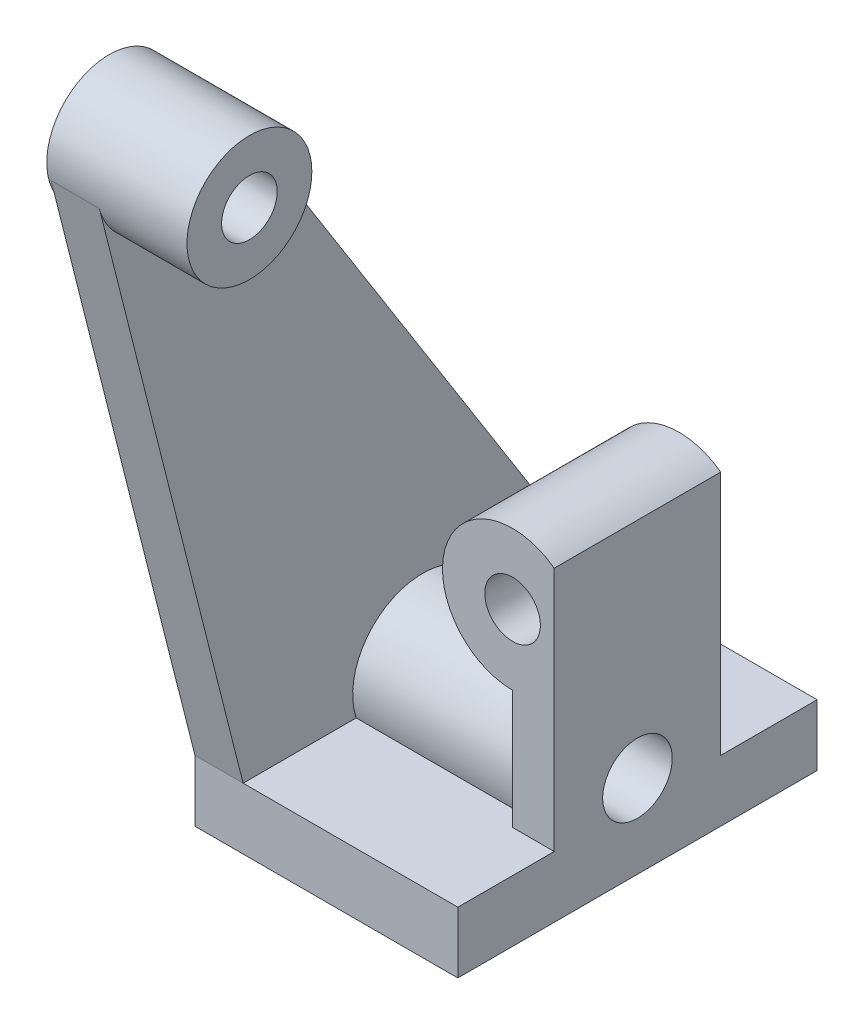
ISO-10303-21;
HEADER;
FILE_DESCRIPTION(('STEP AP214'),'2;1');
FILE_NAME('part.step','',(''),(''),'','','');
FILE_SCHEMA(('AUTOMOTIVE_DESIGN { 1 0 10303 214 1 1 1 1 }'));
ENDSEC;
DATA;
#1=APPLICATION_CONTEXT('core data for automotive mechanical design processes');
#2=APPLICATION_PROTOCOL_DEFINITION('international standard','automotive_design',2000,#1);
#3=PRODUCT_CONTEXT('',#1,'mechanical');
#4=PRODUCT('Part','Part','',(#3));
#5=PRODUCT_RELATED_PRODUCT_CATEGORY('part','',(#4));
#6=PRODUCT_DEFINITION_FORMATION('','',#4);
#7=PRODUCT_DEFINITION_CONTEXT('part definition',#1,'design');
#8=PRODUCT_DEFINITION('design','',#6,#7);
#9=PRODUCT_DEFINITION_SHAPE('','',#8);
#10=(LENGTH_UNIT() NAMED_UNIT(*) SI_UNIT(.MILLI.,.METRE.));
#11=(NAMED_UNIT(*) PLANE_ANGLE_UNIT() SI_UNIT($,.RADIAN.));
#12=(NAMED_UNIT(*) SI_UNIT($,.STERADIAN.) SOLID_ANGLE_UNIT());
#13=UNCERTAINTY_MEASURE_WITH_UNIT(LENGTH_MEASURE(1.E-05),#10,'distance_accuracy_value','');
#14=(GEOMETRIC_REPRESENTATION_CONTEXT(3) GLOBAL_UNCERTAINTY_ASSIGNED_CONTEXT((#13)) GLOBAL_UNIT_ASSIGNED_CONTEXT((#10,
#11,#12)) REPRESENTATION_CONTEXT('',''));
#15=CARTESIAN_POINT('',(0.,0.,0.));
#16=DIRECTION('',(0.,0.,1.));
#17=DIRECTION('',(1.,0.,0.));
#18=AXIS2_PLACEMENT_3D('',#15,#16,#17);
#19=CARTESIAN_POINT('',(60.,28.,82.));
#20=DIRECTION('',(0.,1.,0.));
#21=DIRECTION('',(0.,0.,1.));
#22=AXIS2_PLACEMENT_3D('',#19,#20,#21);
#23=PLANE('',#22);
#24=DIRECTION('',(1.,0.,0.));
#25=VECTOR('',#24,1.);
#26=CARTESIAN_POINT('',(-128.509667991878,28.,30.3973683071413));
#27=LINE('',#26,#25);
#28=CARTESIAN_POINT('',(-38.,28.,30.3973683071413));
#29=VERTEX_POINT('',#28);
#30=CARTESIAN_POINT('',(41.,28.,30.3973683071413));
#31=VERTEX_POINT('',#30);
#32=EDGE_CURVE('E129',#29,#31,#27,.T.);
#33=ORIENTED_EDGE('',*,*,#32,.F.);
#34=DIRECTION('',(0.,0.,1.));
#35=VECTOR('',#34,1.);
#36=CARTESIAN_POINT('',(-38.,28.,-82.));
#37=LINE('',#36,#35);
#38=CARTESIAN_POINT('',(-38.,28.,82.));
#39=VERTEX_POINT('',#38);
#40=EDGE_CURVE('E58',#29,#39,#37,.T.);
#41=ORIENTED_EDGE('',*,*,#40,.T.);
#42=DIRECTION('',(1.,0.,0.));
#43=VECTOR('',#42,1.);
#44=CARTESIAN_POINT('',(-60.,28.,82.));
#45=LINE('',#44,#43);
#46=CARTESIAN_POINT('',(60.,28.,82.));
#47=VERTEX_POINT('',#46);
#48=EDGE_CURVE('E214',#39,#47,#45,.T.);
#49=ORIENTED_EDGE('',*,*,#48,.T.);
#50=DIRECTION('',(0.,0.,-1.));
#51=VECTOR('',#50,1.);
#52=CARTESIAN_POINT('',(60.,28.,-82.));
#53=LINE('',#52,#51);
#54=CARTESIAN_POINT('',(60.,28.,38.));
#55=VERTEX_POINT('',#54);
#56=EDGE_CURVE('E207',#47,#55,#53,.T.);
#57=ORIENTED_EDGE('',*,*,#56,.T.);
#58=DIRECTION('',(1.,0.,0.));
#59=VECTOR('',#58,1.);
#60=CARTESIAN_POINT('',(60.,28.,38.));
#61=LINE('',#60,#59);
#62=CARTESIAN_POINT('',(41.,28.,38.));
#63=VERTEX_POINT('',#62);
#64=EDGE_CURVE('E204',#63,#55,#61,.T.);
#65=ORIENTED_EDGE('',*,*,#64,.F.);
#66=DIRECTION('',(0.,0.,-1.));
#67=VECTOR('',#66,1.);
#68=CARTESIAN_POINT('',(41.,28.,82.));
#69=LINE('',#68,#67);
#70=EDGE_CURVE('E136',#63,#31,#69,.T.);
#71=ORIENTED_EDGE('',*,*,#70,.T.);
#72=EDGE_LOOP('',(#33,#41,#49,#57,#65,#71));
#73=FACE_BOUND('',#72,.T.);
#74=ADVANCED_FACE('F35',(#73),#23,.T.);
#75=DIRECTION('',(1.,0.,0.));
#76=VECTOR('',#75,1.);
#77=CARTESIAN_POINT('',(-128.509667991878,28.,-30.3973683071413));
#78=LINE('',#77,#76);
#79=CARTESIAN_POINT('',(41.,28.,-30.3973683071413));
#80=VERTEX_POINT('',#79);
#81=CARTESIAN_POINT('',(-38.,28.,-30.3973683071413));
#82=VERTEX_POINT('',#81);
#83=EDGE_CURVE('E51',#80,#82,#78,.F.);
#84=ORIENTED_EDGE('',*,*,#83,.F.);
#85=CARTESIAN_POINT('',(41.,28.,-38.));
#86=VERTEX_POINT('',#85);
#87=EDGE_CURVE('E199',#80,#86,#69,.T.);
#88=ORIENTED_EDGE('',*,*,#87,.T.);
#89=DIRECTION('',(1.,0.,0.));
#90=VECTOR('',#89,1.);
#91=CARTESIAN_POINT('',(60.,28.,-38.));
#92=LINE('',#91,#90);
#93=CARTESIAN_POINT('',(60.,28.,-38.));
#94=VERTEX_POINT('',#93);
#95=EDGE_CURVE('E201',#86,#94,#92,.T.);
#96=ORIENTED_EDGE('',*,*,#95,.T.);
#97=CARTESIAN_POINT('',(60.,28.,-82.));
#98=VERTEX_POINT('',#97);
#99=EDGE_CURVE('E211',#94,#98,#53,.T.);
#100=ORIENTED_EDGE('',*,*,#99,.T.);
#101=DIRECTION('',(-1.,0.,0.));
#102=VECTOR('',#101,1.);
#103=CARTESIAN_POINT('',(-60.,28.,-82.));
#104=LINE('',#103,#102);
#105=CARTESIAN_POINT('',(-38.,28.,-82.));
#106=VERTEX_POINT('',#105);
#107=EDGE_CURVE('E210',#98,#106,#104,.T.);
#108=ORIENTED_EDGE('',*,*,#107,.T.);
#109=EDGE_CURVE('E143',#106,#82,#37,.T.);
#110=ORIENTED_EDGE('',*,*,#109,.T.);
#111=EDGE_LOOP('',(#84,#88,#96,#100,#108,#110));
#112=FACE_BOUND('',#111,.T.);
#113=ADVANCED_FACE('F266',(#112),#23,.T.);
#114=CARTESIAN_POINT('',(60.,28.,-82.));
#115=DIRECTION('',(-1.,0.,0.));
#116=DIRECTION('',(0.,0.,1.));
#117=AXIS2_PLACEMENT_3D('',#114,#115,#116);
#118=PLANE('',#117);
#119=CARTESIAN_POINT('',(60.,38.,0.));
#120=DIRECTION('',(1.,0.,0.));
#121=DIRECTION('',(0.,0.,-1.));
#122=AXIS2_PLACEMENT_3D('',#119,#120,#121);
#123=CIRCLE('',#122,15.875);
#124=CARTESIAN_POINT('',(60.,38.,-15.875));
#125=VERTEX_POINT('',#124);
#126=EDGE_CURVE('E290',#125,#125,#123,.T.);
#127=ORIENTED_EDGE('',*,*,#126,.F.);
#128=EDGE_LOOP('',(#127));
#129=FACE_BOUND('',#128,.T.);
#130=DIRECTION('',(0.,0.,-1.));
#131=VECTOR('',#130,1.);
#132=CARTESIAN_POINT('',(60.,0.,-82.));
#133=LINE('',#132,#131);
#134=CARTESIAN_POINT('',(60.,0.,82.));
#135=VERTEX_POINT('',#134);
#136=CARTESIAN_POINT('',(60.,0.,-82.));
#137=VERTEX_POINT('',#136);
#138=EDGE_CURVE('E206',#135,#137,#133,.T.);
#139=ORIENTED_EDGE('',*,*,#138,.T.);
#140=DIRECTION('',(0.,-1.,0.));
#141=VECTOR('',#140,1.);
#142=CARTESIAN_POINT('',(60.,28.,-82.));
#143=LINE('',#142,#141);
#144=EDGE_CURVE('E44',#98,#137,#143,.T.);
#145=ORIENTED_EDGE('',*,*,#144,.F.);
#146=ORIENTED_EDGE('',*,*,#99,.F.);
#147=DIRECTION('',(0.,1.,0.));
#148=VECTOR('',#147,1.);
#149=CARTESIAN_POINT('',(60.,0.,-38.));
#150=LINE('',#149,#148);
#151=CARTESIAN_POINT('',(60.,139.998786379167,-38.));
#152=VERTEX_POINT('',#151);
#153=EDGE_CURVE('E177',#94,#152,#150,.T.);
#154=ORIENTED_EDGE('',*,*,#153,.T.);
#155=DIRECTION('',(0.,0.,-1.));
#156=VECTOR('',#155,1.);
#157=CARTESIAN_POINT('',(60.,139.998786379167,38.));
#158=LINE('',#157,#156);
#159=CARTESIAN_POINT('',(60.,139.998786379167,38.));
#160=VERTEX_POINT('',#159);
#161=EDGE_CURVE('E196',#160,#152,#158,.T.);
#162=ORIENTED_EDGE('',*,*,#161,.F.);
#163=DIRECTION('',(0.,1.,0.));
#164=VECTOR('',#163,1.);
#165=CARTESIAN_POINT('',(60.,0.,38.));
#166=LINE('',#165,#164);
#167=EDGE_CURVE('E180',#55,#160,#166,.T.);
#168=ORIENTED_EDGE('',*,*,#167,.F.);
#169=ORIENTED_EDGE('',*,*,#56,.F.);
#170=DIRECTION('',(0.,-1.,0.));
#171=VECTOR('',#170,1.);
#172=CARTESIAN_POINT('',(60.,28.,82.));
#173=LINE('',#172,#171);
#174=EDGE_CURVE('E218',#47,#135,#173,.T.);
#175=ORIENTED_EDGE('',*,*,#174,.T.);
#176=EDGE_LOOP('',(#139,#145,#146,#154,#162,#168,#169,#175));
#177=FACE_BOUND('',#176,.T.);
#178=ADVANCED_FACE('F37',(#129,#177),#118,.F.);
#179=CARTESIAN_POINT('',(-60.,28.,-82.));
#180=DIRECTION('',(0.,0.,1.));
#181=DIRECTION('',(1.,0.,0.));
#182=AXIS2_PLACEMENT_3D('',#179,#180,#181);
#183=PLANE('',#182);
#184=DIRECTION('',(-1.,0.,0.));
#185=VECTOR('',#184,1.);
#186=CARTESIAN_POINT('',(-60.,0.,-82.));
#187=LINE('',#186,#185);
#188=CARTESIAN_POINT('',(-60.,0.,-82.));
#189=VERTEX_POINT('',#188);
#190=EDGE_CURVE('E220',#137,#189,#187,.T.);
#191=ORIENTED_EDGE('',*,*,#190,.T.);
#192=DIRECTION('',(0.,-1.,0.));
#193=VECTOR('',#192,1.);
#194=CARTESIAN_POINT('',(-60.,28.,-82.));
#195=LINE('',#194,#193);
#196=CARTESIAN_POINT('',(-60.,28.,-82.));
#197=VERTEX_POINT('',#196);
#198=EDGE_CURVE('E231',#197,#189,#195,.T.);
#199=ORIENTED_EDGE('',*,*,#198,.F.);
#200=DIRECTION('',(-1.,0.,0.));
#201=VECTOR('',#200,1.);
#202=CARTESIAN_POINT('',(-38.,28.,-82.));
#203=LINE('',#202,#201);
#204=EDGE_CURVE('E166',#106,#197,#203,.T.);
#205=ORIENTED_EDGE('',*,*,#204,.F.);
#206=ORIENTED_EDGE('',*,*,#107,.F.);
#207=ORIENTED_EDGE('',*,*,#144,.T.);
#208=EDGE_LOOP('',(#191,#199,#205,#206,#207));
#209=FACE_BOUND('',#208,.T.);
#210=ADVANCED_FACE('F238',(#209),#183,.F.);
#211=CARTESIAN_POINT('',(-60.,28.,-82.));
#212=DIRECTION('',(1.,0.,0.));
#213=DIRECTION('',(0.,0.,-1.));
#214=AXIS2_PLACEMENT_3D('',#211,#212,#213);
#215=PLANE('',#214);
#216=CARTESIAN_POINT('',(-60.,38.,0.));
#217=DIRECTION('',(1.,0.,0.));
#218=DIRECTION('',(0.,0.,-1.));
#219=AXIS2_PLACEMENT_3D('',#216,#217,#218);
#220=CIRCLE('',#219,15.875);
#221=CARTESIAN_POINT('',(-60.,38.,-15.875));
#222=VERTEX_POINT('',#221);
#223=EDGE_CURVE('E39',#222,#222,#220,.T.);
#224=ORIENTED_EDGE('',*,*,#223,.T.);
#225=EDGE_LOOP('',(#224));
#226=FACE_BOUND('',#225,.T.);
#227=DIRECTION('',(0.,0.,1.));
#228=VECTOR('',#227,1.);
#229=CARTESIAN_POINT('',(-60.,0.,-82.));
#230=LINE('',#229,#228);
#231=CARTESIAN_POINT('',(-60.,0.,82.));
#232=VERTEX_POINT('',#231);
#233=EDGE_CURVE('E222',#189,#232,#230,.T.);
#234=ORIENTED_EDGE('',*,*,#233,.T.);
#235=DIRECTION('',(0.,-1.,0.));
#236=VECTOR('',#235,1.);
#237=CARTESIAN_POINT('',(-60.,28.,82.));
#238=LINE('',#237,#236);
#239=CARTESIAN_POINT('',(-60.,28.,82.));
#240=VERTEX_POINT('',#239);
#241=EDGE_CURVE('E228',#240,#232,#238,.T.);
#242=ORIENTED_EDGE('',*,*,#241,.F.);
#243=DIRECTION('',(0.,0.969589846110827,0.244735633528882));
#244=VECTOR('',#243,1.);
#245=CARTESIAN_POINT('',(-60.,28.,82.));
#246=LINE('',#245,#244);
#247=CARTESIAN_POINT('',(-60.,288.025034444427,147.633310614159));
#248=VERTEX_POINT('',#247);
#249=EDGE_CURVE('E161',#240,#248,#246,.T.);
#250=ORIENTED_EDGE('',*,*,#249,.T.);
#251=CARTESIAN_POINT('',(-60.,295.,120.));
#252=DIRECTION('',(1.,0.,0.));
#253=DIRECTION('',(0.,0.,1.));
#254=AXIS2_PLACEMENT_3D('',#251,#252,#253);
#255=CIRCLE('',#254,28.5);
#256=CARTESIAN_POINT('',(-60.,310.198037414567,95.8904653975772));
#257=VERTEX_POINT('',#256);
#258=EDGE_CURVE('E147',#248,#257,#255,.T.);
#259=ORIENTED_EDGE('',*,*,#258,.T.);
#260=DIRECTION('',(0.,-0.84594858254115,-0.533264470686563));
#261=VECTOR('',#260,1.);
#262=CARTESIAN_POINT('',(-60.,28.,-82.));
#263=LINE('',#262,#261);
#264=EDGE_CURVE('E144',#257,#197,#263,.T.);
#265=ORIENTED_EDGE('',*,*,#264,.T.);
#266=ORIENTED_EDGE('',*,*,#198,.T.);
#267=EDGE_LOOP('',(#234,#242,#250,#259,#265,#266));
#268=FACE_BOUND('',#267,.T.);
#269=ADVANCED_FACE('F251',(#226,#268),#215,.F.);
#270=CARTESIAN_POINT('',(-60.,28.,82.));
#271=DIRECTION('',(0.,0.,-1.));
#272=DIRECTION('',(-1.,0.,0.));
#273=AXIS2_PLACEMENT_3D('',#270,#271,#272);
#274=PLANE('',#273);
#275=DIRECTION('',(1.,0.,0.));
#276=VECTOR('',#275,1.);
#277=CARTESIAN_POINT('',(-60.,0.,82.));
#278=LINE('',#277,#276);
#279=EDGE_CURVE('E224',#232,#135,#278,.T.);
#280=ORIENTED_EDGE('',*,*,#279,.T.);
#281=ORIENTED_EDGE('',*,*,#174,.F.);
#282=ORIENTED_EDGE('',*,*,#48,.F.);
#283=EDGE_CURVE('E215',#240,#39,#45,.T.);
#284=ORIENTED_EDGE('',*,*,#283,.F.);
#285=ORIENTED_EDGE('',*,*,#241,.T.);
#286=EDGE_LOOP('',(#280,#281,#282,#284,#285));
#287=FACE_BOUND('',#286,.T.);
#288=ADVANCED_FACE('F254',(#287),#274,.F.);
#289=CARTESIAN_POINT('',(60.,0.,82.));
#290=DIRECTION('',(0.,1.,0.));
#291=DIRECTION('',(0.,0.,1.));
#292=AXIS2_PLACEMENT_3D('',#289,#290,#291);
#293=PLANE('',#292);
#294=ORIENTED_EDGE('',*,*,#190,.F.);
#295=ORIENTED_EDGE('',*,*,#138,.F.);
#296=ORIENTED_EDGE('',*,*,#279,.F.);
#297=ORIENTED_EDGE('',*,*,#233,.F.);
#298=EDGE_LOOP('',(#294,#295,#296,#297));
#299=FACE_BOUND('',#298,.T.);
#300=ADVANCED_FACE('F248',(#299),#293,.F.);
#301=CARTESIAN_POINT('',(41.,114.25,38.));
#302=DIRECTION('',(0.,0.,1.));
#303=DIRECTION('',(1.,0.,0.));
#304=AXIS2_PLACEMENT_3D('',#301,#302,#303);
#305=PLANE('',#304);
#306=DIRECTION('',(0.,-1.,0.));
#307=VECTOR('',#306,1.);
#308=CARTESIAN_POINT('',(41.,82.25,38.));
#309=LINE('',#308,#307);
#310=CARTESIAN_POINT('',(41.,82.25,38.));
#311=VERTEX_POINT('',#310);
#312=EDGE_CURVE('E185',#311,#63,#309,.T.);
#313=ORIENTED_EDGE('',*,*,#312,.T.);
#314=ORIENTED_EDGE('',*,*,#64,.T.);
#315=ORIENTED_EDGE('',*,*,#167,.T.);
#316=CARTESIAN_POINT('',(41.,114.25,38.));
#317=DIRECTION('',(0.,0.,1.));
#318=DIRECTION('',(1.,0.,0.));
#319=AXIS2_PLACEMENT_3D('',#316,#317,#318);
#320=CIRCLE('',#319,32.);
#321=EDGE_CURVE('E182',#160,#311,#320,.T.);
#322=ORIENTED_EDGE('',*,*,#321,.T.);
#323=EDGE_LOOP('',(#313,#314,#315,#322));
#324=FACE_BOUND('',#323,.T.);
#325=CARTESIAN_POINT('',(41.,114.25,38.));
#326=DIRECTION('',(0.,0.,1.));
#327=DIRECTION('',(1.,0.,0.));
#328=AXIS2_PLACEMENT_3D('',#325,#326,#327);
#329=CIRCLE('',#328,12.7);
#330=CARTESIAN_POINT('',(53.7,114.25,38.));
#331=VERTEX_POINT('',#330);
#332=EDGE_CURVE('E174',#331,#331,#329,.T.);
#333=ORIENTED_EDGE('',*,*,#332,.F.);
#334=EDGE_LOOP('',(#333));
#335=FACE_BOUND('',#334,.T.);
#336=ADVANCED_FACE('F282',(#324,#335),#305,.T.);
#337=CARTESIAN_POINT('',(41.,114.25,-38.));
#338=DIRECTION('',(0.,0.,1.));
#339=DIRECTION('',(1.,0.,0.));
#340=AXIS2_PLACEMENT_3D('',#337,#338,#339);
#341=PLANE('',#340);
#342=ORIENTED_EDGE('',*,*,#95,.F.);
#343=DIRECTION('',(0.,-1.,0.));
#344=VECTOR('',#343,1.);
#345=CARTESIAN_POINT('',(41.,82.25,-38.));
#346=LINE('',#345,#344);
#347=CARTESIAN_POINT('',(41.,82.25,-38.));
#348=VERTEX_POINT('',#347);
#349=EDGE_CURVE('E183',#348,#86,#346,.T.);
#350=ORIENTED_EDGE('',*,*,#349,.F.);
#351=CARTESIAN_POINT('',(41.,114.25,-38.));
#352=DIRECTION('',(0.,0.,1.));
#353=DIRECTION('',(1.,0.,0.));
#354=AXIS2_PLACEMENT_3D('',#351,#352,#353);
#355=CIRCLE('',#354,32.);
#356=EDGE_CURVE('E190',#152,#348,#355,.T.);
#357=ORIENTED_EDGE('',*,*,#356,.F.);
#358=ORIENTED_EDGE('',*,*,#153,.F.);
#359=EDGE_LOOP('',(#342,#350,#357,#358));
#360=FACE_BOUND('',#359,.T.);
#361=CARTESIAN_POINT('',(41.,114.25,-38.));
#362=DIRECTION('',(0.,0.,1.));
#363=DIRECTION('',(1.,0.,0.));
#364=AXIS2_PLACEMENT_3D('',#361,#362,#363);
#365=CIRCLE('',#364,12.7);
#366=CARTESIAN_POINT('',(53.7,114.25,-38.));
#367=VERTEX_POINT('',#366);
#368=EDGE_CURVE('E169',#367,#367,#365,.T.);
#369=ORIENTED_EDGE('',*,*,#368,.T.);
#370=EDGE_LOOP('',(#369));
#371=FACE_BOUND('',#370,.T.);
#372=ADVANCED_FACE('F271',(#360,#371),#341,.F.);
#373=CARTESIAN_POINT('',(41.,114.25,38.));
#374=DIRECTION('',(0.,0.,-1.));
#375=DIRECTION('',(-1.,0.,0.));
#376=AXIS2_PLACEMENT_3D('',#373,#374,#375);
#377=CYLINDRICAL_SURFACE('',#376,32.);
#378=ORIENTED_EDGE('',*,*,#356,.T.);
#379=DIRECTION('',(0.,0.,-1.));
#380=VECTOR('',#379,1.);
#381=CARTESIAN_POINT('',(41.,82.25,38.));
#382=LINE('',#381,#380);
#383=EDGE_CURVE('E188',#311,#348,#382,.T.);
#384=ORIENTED_EDGE('',*,*,#383,.F.);
#385=ORIENTED_EDGE('',*,*,#321,.F.);
#386=ORIENTED_EDGE('',*,*,#161,.T.);
#387=EDGE_LOOP('',(#378,#384,#385,#386));
#388=FACE_BOUND('',#387,.T.);
#389=ADVANCED_FACE('F278',(#388),#377,.T.);
#390=CARTESIAN_POINT('',(41.,82.25,38.));
#391=DIRECTION('',(1.,0.,0.));
#392=DIRECTION('',(0.,0.,-1.));
#393=AXIS2_PLACEMENT_3D('',#390,#391,#392);
#394=PLANE('',#393);
#395=ORIENTED_EDGE('',*,*,#87,.F.);
#396=CARTESIAN_POINT('',(41.,38.,0.));
#397=DIRECTION('',(1.,0.,0.));
#398=DIRECTION('',(0.,0.,-1.));
#399=AXIS2_PLACEMENT_3D('',#396,#397,#398);
#400=CIRCLE('',#399,32.);
#401=EDGE_CURVE('E286',#80,#31,#400,.T.);
#402=ORIENTED_EDGE('',*,*,#401,.T.);
#403=ORIENTED_EDGE('',*,*,#70,.F.);
#404=ORIENTED_EDGE('',*,*,#312,.F.);
#405=ORIENTED_EDGE('',*,*,#383,.T.);
#406=ORIENTED_EDGE('',*,*,#349,.T.);
#407=EDGE_LOOP('',(#395,#402,#403,#404,#405,#406));
#408=FACE_BOUND('',#407,.T.);
#409=ADVANCED_FACE('F285',(#408),#394,.F.);
#410=CARTESIAN_POINT('',(41.,114.25,38.));
#411=DIRECTION('',(0.,0.,-1.));
#412=DIRECTION('',(-1.,0.,0.));
#413=AXIS2_PLACEMENT_3D('',#410,#411,#412);
#414=CYLINDRICAL_SURFACE('',#413,12.7);
#415=ORIENTED_EDGE('',*,*,#332,.T.);
#416=EDGE_LOOP('',(#415));
#417=FACE_BOUND('',#416,.T.);
#418=ORIENTED_EDGE('',*,*,#368,.F.);
#419=EDGE_LOOP('',(#418));
#420=FACE_BOUND('',#419,.T.);
#421=ADVANCED_FACE('F425',(#417,#420),#414,.F.);
#422=CARTESIAN_POINT('',(-38.,28.,-82.));
#423=DIRECTION('',(0.,0.533264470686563,-0.84594858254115));
#424=DIRECTION('',(0.,0.84594858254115,0.533264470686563));
#425=AXIS2_PLACEMENT_3D('',#422,#423,#424);
#426=PLANE('',#425);
#427=ORIENTED_EDGE('',*,*,#264,.F.);
#428=DIRECTION('',(-1.,0.,0.));
#429=VECTOR('',#428,1.);
#430=CARTESIAN_POINT('',(-38.,310.198037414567,95.8904653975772));
#431=LINE('',#430,#429);
#432=CARTESIAN_POINT('',(-38.,310.198037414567,95.8904653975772));
#433=VERTEX_POINT('',#432);
#434=EDGE_CURVE('E170',#433,#257,#431,.T.);
#435=ORIENTED_EDGE('',*,*,#434,.F.);
#436=DIRECTION('',(0.,-0.84594858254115,-0.533264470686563));
#437=VECTOR('',#436,1.);
#438=CARTESIAN_POINT('',(-38.,28.,-82.));
#439=LINE('',#438,#437);
#440=EDGE_CURVE('E157',#433,#106,#439,.T.);
#441=ORIENTED_EDGE('',*,*,#440,.T.);
#442=ORIENTED_EDGE('',*,*,#204,.T.);
#443=EDGE_LOOP('',(#427,#435,#441,#442));
#444=FACE_BOUND('',#443,.T.);
#445=ADVANCED_FACE('F264',(#444),#426,.T.);
#446=CARTESIAN_POINT('',(-38.,28.,82.));
#447=DIRECTION('',(0.,-0.244735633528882,0.969589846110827));
#448=DIRECTION('',(0.,-0.969589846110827,-0.244735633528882));
#449=AXIS2_PLACEMENT_3D('',#446,#447,#448);
#450=PLANE('',#449);
#451=ORIENTED_EDGE('',*,*,#249,.F.);
#452=ORIENTED_EDGE('',*,*,#283,.T.);
#453=DIRECTION('',(0.,0.969589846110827,0.244735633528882));
#454=VECTOR('',#453,1.);
#455=CARTESIAN_POINT('',(-38.,28.,82.));
#456=LINE('',#455,#454);
#457=CARTESIAN_POINT('',(-38.,288.025034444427,147.633310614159));
#458=VERTEX_POINT('',#457);
#459=EDGE_CURVE('E142',#39,#458,#456,.T.);
#460=ORIENTED_EDGE('',*,*,#459,.T.);
#461=DIRECTION('',(-1.,0.,0.));
#462=VECTOR('',#461,1.);
#463=CARTESIAN_POINT('',(-38.,288.025034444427,147.633310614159));
#464=LINE('',#463,#462);
#465=EDGE_CURVE('E160',#458,#248,#464,.T.);
#466=ORIENTED_EDGE('',*,*,#465,.T.);
#467=EDGE_LOOP('',(#451,#452,#460,#466));
#468=FACE_BOUND('',#467,.T.);
#469=ADVANCED_FACE('F256',(#468),#450,.T.);
#470=CARTESIAN_POINT('',(-38.,295.,120.));
#471=DIRECTION('',(-1.,0.,0.));
#472=DIRECTION('',(0.,0.,1.));
#473=AXIS2_PLACEMENT_3D('',#470,#471,#472);
#474=PLANE('',#473);
#475=ORIENTED_EDGE('',*,*,#40,.F.);
#476=CARTESIAN_POINT('',(-38.,38.,0.));
#477=DIRECTION('',(-1.,0.,0.));
#478=DIRECTION('',(0.,0.,1.));
#479=AXIS2_PLACEMENT_3D('',#476,#477,#478);
#480=CIRCLE('',#479,32.);
#481=EDGE_CURVE('E11',#29,#82,#480,.T.);
#482=ORIENTED_EDGE('',*,*,#481,.T.);
#483=ORIENTED_EDGE('',*,*,#109,.F.);
#484=ORIENTED_EDGE('',*,*,#440,.F.);
#485=CARTESIAN_POINT('',(-38.,295.,120.));
#486=DIRECTION('',(1.,0.,0.));
#487=DIRECTION('',(0.,0.,1.));
#488=AXIS2_PLACEMENT_3D('',#485,#486,#487);
#489=CIRCLE('',#488,28.5);
#490=EDGE_CURVE('E154',#458,#433,#489,.T.);
#491=ORIENTED_EDGE('',*,*,#490,.F.);
#492=ORIENTED_EDGE('',*,*,#459,.F.);
#493=EDGE_LOOP('',(#475,#482,#483,#484,#491,#492));
#494=FACE_BOUND('',#493,.T.);
#495=ADVANCED_FACE('F140',(#494),#474,.F.);
#496=CARTESIAN_POINT('',(-61.12,295.,120.));
#497=DIRECTION('',(1.,0.,0.));
#498=DIRECTION('',(0.,0.,-1.));
#499=AXIS2_PLACEMENT_3D('',#496,#497,#498);
#500=CYLINDRICAL_SURFACE('',#499,28.5);
#501=CARTESIAN_POINT('',(2.88000000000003,295.,120.));
#502=DIRECTION('',(1.,0.,0.));
#503=DIRECTION('',(0.,0.,-1.));
#504=AXIS2_PLACEMENT_3D('',#501,#502,#503);
#505=CIRCLE('',#504,28.5);
#506=CARTESIAN_POINT('',(2.88000000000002,295.,91.5));
#507=VERTEX_POINT('',#506);
#508=EDGE_CURVE('E151',#507,#507,#505,.T.);
#509=ORIENTED_EDGE('',*,*,#508,.F.);
#510=EDGE_LOOP('',(#509));
#511=FACE_BOUND('',#510,.T.);
#512=CARTESIAN_POINT('',(-61.12,295.,120.));
#513=DIRECTION('',(1.,0.,0.));
#514=DIRECTION('',(0.,0.,-1.));
#515=AXIS2_PLACEMENT_3D('',#512,#513,#514);
#516=CIRCLE('',#515,28.5);
#517=CARTESIAN_POINT('',(-61.12,295.,91.5));
#518=VERTEX_POINT('',#517);
#519=EDGE_CURVE('E164',#518,#518,#516,.T.);
#520=ORIENTED_EDGE('',*,*,#519,.T.);
#521=EDGE_LOOP('',(#520));
#522=FACE_BOUND('',#521,.T.);
#523=ORIENTED_EDGE('',*,*,#258,.F.);
#524=ORIENTED_EDGE('',*,*,#465,.F.);
#525=ORIENTED_EDGE('',*,*,#490,.T.);
#526=ORIENTED_EDGE('',*,*,#434,.T.);
#527=EDGE_LOOP('',(#523,#524,#525,#526));
#528=FACE_BOUND('',#527,.T.);
#529=ADVANCED_FACE('F261',(#511,#522,#528),#500,.T.);
#530=CARTESIAN_POINT('',(-61.12,295.,120.));
#531=DIRECTION('',(1.,0.,0.));
#532=DIRECTION('',(0.,0.,-1.));
#533=AXIS2_PLACEMENT_3D('',#530,#531,#532);
#534=PLANE('',#533);
#535=CARTESIAN_POINT('',(-61.12,295.,120.));
#536=DIRECTION('',(1.,0.,0.));
#537=DIRECTION('',(0.,0.,-1.));
#538=AXIS2_PLACEMENT_3D('',#535,#536,#537);
#539=CIRCLE('',#538,12.7);
#540=CARTESIAN_POINT('',(-61.12,295.,107.3));
#541=VERTEX_POINT('',#540);
#542=EDGE_CURVE('E293',#541,#541,#539,.T.);
#543=ORIENTED_EDGE('',*,*,#542,.T.);
#544=EDGE_LOOP('',(#543));
#545=FACE_BOUND('',#544,.T.);
#546=ORIENTED_EDGE('',*,*,#519,.F.);
#547=EDGE_LOOP('',(#546));
#548=FACE_BOUND('',#547,.T.);
#549=ADVANCED_FACE('F306',(#545,#548),#534,.F.);
#550=CARTESIAN_POINT('',(2.88000000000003,295.,120.));
#551=DIRECTION('',(1.,0.,0.));
#552=DIRECTION('',(0.,0.,-1.));
#553=AXIS2_PLACEMENT_3D('',#550,#551,#552);
#554=PLANE('',#553);
#555=CARTESIAN_POINT('',(2.88000000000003,295.,120.));
#556=DIRECTION('',(1.,0.,0.));
#557=DIRECTION('',(0.,0.,-1.));
#558=AXIS2_PLACEMENT_3D('',#555,#556,#557);
#559=CIRCLE('',#558,12.7);
#560=CARTESIAN_POINT('',(2.88000000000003,295.,107.3));
#561=VERTEX_POINT('',#560);
#562=EDGE_CURVE('E137',#561,#561,#559,.T.);
#563=ORIENTED_EDGE('',*,*,#562,.F.);
#564=EDGE_LOOP('',(#563));
#565=FACE_BOUND('',#564,.T.);
#566=ORIENTED_EDGE('',*,*,#508,.T.);
#567=EDGE_LOOP('',(#566));
#568=FACE_BOUND('',#567,.T.);
#569=ADVANCED_FACE('F303',(#565,#568),#554,.T.);
#570=CARTESIAN_POINT('',(-61.12,295.,120.));
#571=DIRECTION('',(1.,0.,0.));
#572=DIRECTION('',(0.,0.,-1.));
#573=AXIS2_PLACEMENT_3D('',#570,#571,#572);
#574=CYLINDRICAL_SURFACE('',#573,12.7);
#575=ORIENTED_EDGE('',*,*,#542,.F.);
#576=EDGE_LOOP('',(#575));
#577=FACE_BOUND('',#576,.T.);
#578=ORIENTED_EDGE('',*,*,#562,.T.);
#579=EDGE_LOOP('',(#578));
#580=FACE_BOUND('',#579,.T.);
#581=ADVANCED_FACE('F348',(#577,#580),#574,.F.);
#582=CARTESIAN_POINT('',(-128.509667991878,38.,0.));
#583=DIRECTION('',(1.,0.,0.));
#584=DIRECTION('',(0.,0.,-1.));
#585=AXIS2_PLACEMENT_3D('',#582,#583,#584);
#586=CYLINDRICAL_SURFACE('',#585,32.);
#587=ORIENTED_EDGE('',*,*,#481,.F.);
#588=ORIENTED_EDGE('',*,*,#32,.T.);
#589=ORIENTED_EDGE('',*,*,#401,.F.);
#590=ORIENTED_EDGE('',*,*,#83,.T.);
#591=EDGE_LOOP('',(#587,#588,#589,#590));
#592=FACE_BOUND('',#591,.T.);
#593=ADVANCED_FACE('F128',(#592),#586,.T.);
#594=CARTESIAN_POINT('',(-61.12,38.,0.));
#595=DIRECTION('',(1.,0.,0.));
#596=DIRECTION('',(0.,0.,-1.));
#597=AXIS2_PLACEMENT_3D('',#594,#595,#596);
#598=CYLINDRICAL_SURFACE('',#597,15.875);
#599=ORIENTED_EDGE('',*,*,#126,.T.);
#600=EDGE_LOOP('',(#599));
#601=FACE_BOUND('',#600,.T.);
#602=ORIENTED_EDGE('',*,*,#223,.F.);
#603=EDGE_LOOP('',(#602));
#604=FACE_BOUND('',#603,.T.);
#605=ADVANCED_FACE('F340',(#601,#604),#598,.F.);
#606=CLOSED_SHELL('',(#74,#113,#178,#210,#269,#288,#300,#336,#372,#389,#409,#421,#445,#469,#495,
#529,#549,#569,#581,#593,#605));
#607=MANIFOLD_SOLID_BREP('B2',#606);
#608=ADVANCED_BREP_SHAPE_REPRESENTATION('',(#18,#607),#14);
#609=SHAPE_DEFINITION_REPRESENTATION(#9,#608);
ENDSEC;
END-ISO-10303-21;
